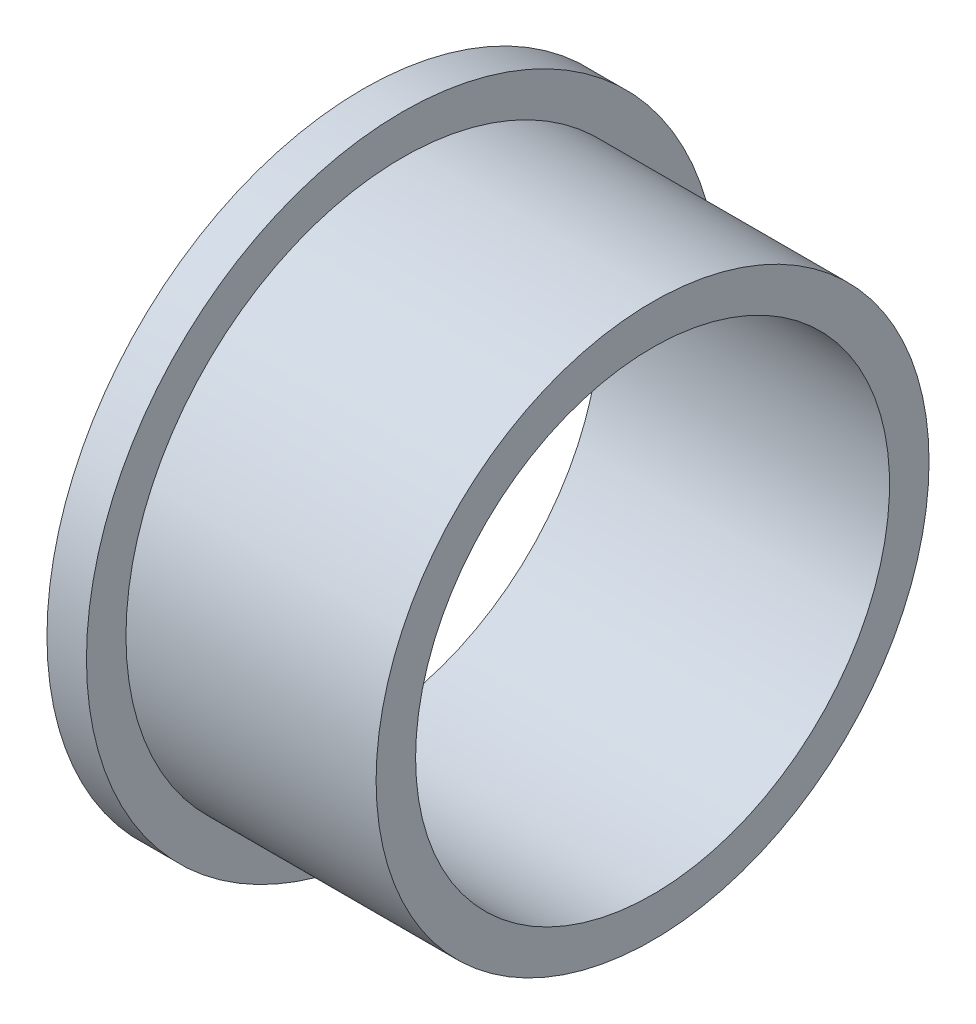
from build123d import *


with BuildPart() as part:
    # Schizzo1 → Rivoluzione1 (revolve)
    with BuildSketch(Plane.XY, mode=Mode.PRIVATE) as rivoluzione1_sk:
        Polygon((-11, 24), (-8, 24), (-8, 21), (11, 21), (11, 18), (-11, 18), align=None)
    revolve(rivoluzione1_sk.sketch.rotate(Axis((-11, 0, 0), (1, 0, 0)), 90), axis=Axis((-11, 0, 0), (1, 0, 0)))


solid = part.part
